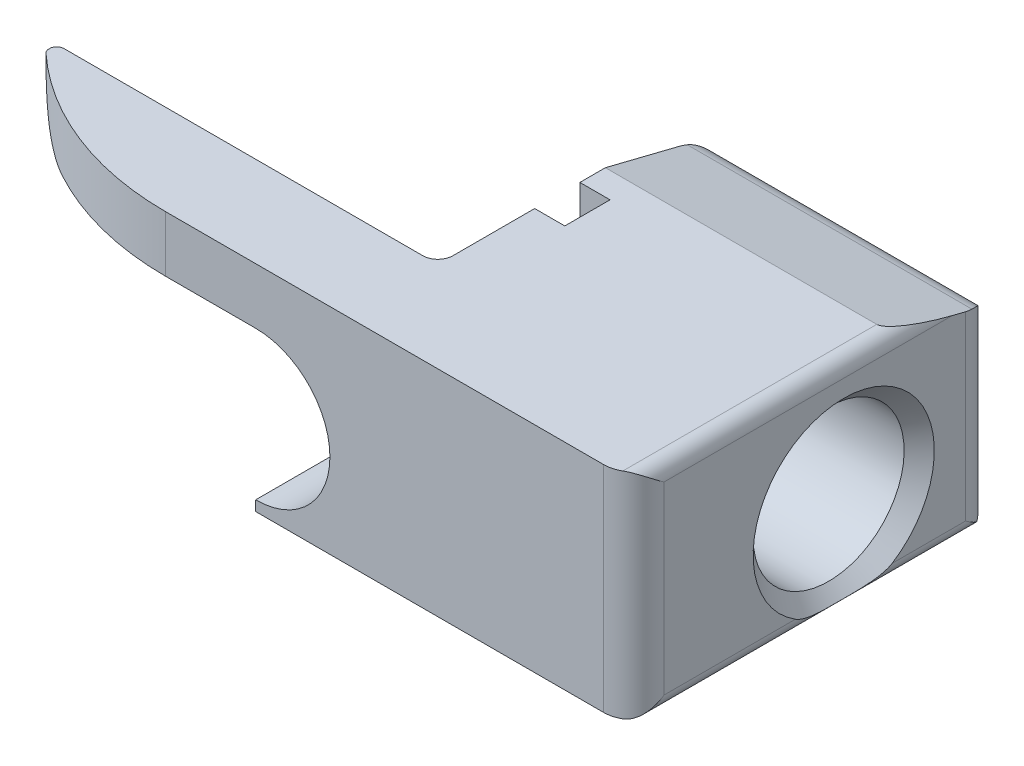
ISO-10303-21;
HEADER;
FILE_DESCRIPTION(('STEP AP214'),'2;1');
FILE_NAME('part.step','',(''),(''),'','','');
FILE_SCHEMA(('AUTOMOTIVE_DESIGN { 1 0 10303 214 1 1 1 1 }'));
ENDSEC;
DATA;
#1=APPLICATION_CONTEXT('core data for automotive mechanical design processes');
#2=APPLICATION_PROTOCOL_DEFINITION('international standard','automotive_design',2000,#1);
#3=PRODUCT_CONTEXT('',#1,'mechanical');
#4=PRODUCT('Part','Part','',(#3));
#5=PRODUCT_RELATED_PRODUCT_CATEGORY('part','',(#4));
#6=PRODUCT_DEFINITION_FORMATION('','',#4);
#7=PRODUCT_DEFINITION_CONTEXT('part definition',#1,'design');
#8=PRODUCT_DEFINITION('design','',#6,#7);
#9=PRODUCT_DEFINITION_SHAPE('','',#8);
#10=(LENGTH_UNIT() NAMED_UNIT(*) SI_UNIT(.MILLI.,.METRE.));
#11=(NAMED_UNIT(*) PLANE_ANGLE_UNIT() SI_UNIT($,.RADIAN.));
#12=(NAMED_UNIT(*) SI_UNIT($,.STERADIAN.) SOLID_ANGLE_UNIT());
#13=UNCERTAINTY_MEASURE_WITH_UNIT(LENGTH_MEASURE(1.E-05),#10,'distance_accuracy_value','');
#14=(GEOMETRIC_REPRESENTATION_CONTEXT(3) GLOBAL_UNCERTAINTY_ASSIGNED_CONTEXT((#13)) GLOBAL_UNIT_ASSIGNED_CONTEXT((#10,
#11,#12)) REPRESENTATION_CONTEXT('',''));
#15=CARTESIAN_POINT('',(0.,0.,0.));
#16=DIRECTION('',(0.,0.,1.));
#17=DIRECTION('',(1.,0.,0.));
#18=AXIS2_PLACEMENT_3D('',#15,#16,#17);
#19=CARTESIAN_POINT('',(-5.55624999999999,5.6515,-8.001));
#20=DIRECTION('',(0.,0.,1.));
#21=DIRECTION('',(1.,0.,0.));
#22=AXIS2_PLACEMENT_3D('',#19,#20,#21);
#23=PLANE('',#22);
#24=DIRECTION('',(0.,-1.,0.));
#25=VECTOR('',#24,1.);
#26=CARTESIAN_POINT('',(6.34999999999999,5.6515,-8.001));
#27=LINE('',#26,#25);
#28=CARTESIAN_POINT('',(6.34999999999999,3.04745640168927,-8.001));
#29=VERTEX_POINT('',#28);
#30=CARTESIAN_POINT('',(6.35,-4.064,-8.001));
#31=VERTEX_POINT('',#30);
#32=EDGE_CURVE('E295',#29,#31,#27,.T.);
#33=ORIENTED_EDGE('',*,*,#32,.T.);
#34=DIRECTION('',(1.,0.,0.));
#35=VECTOR('',#34,1.);
#36=CARTESIAN_POINT('',(-27.2138632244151,-4.064,-8.001));
#37=LINE('',#36,#35);
#38=CARTESIAN_POINT('',(-5.55625,-4.064,-8.001));
#39=VERTEX_POINT('',#38);
#40=EDGE_CURVE('E241',#39,#31,#37,.T.);
#41=ORIENTED_EDGE('',*,*,#40,.F.);
#42=DIRECTION('',(0.,-1.,0.));
#43=VECTOR('',#42,1.);
#44=CARTESIAN_POINT('',(-5.55624999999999,5.6515,-8.001));
#45=LINE('',#44,#43);
#46=CARTESIAN_POINT('',(-5.55625,3.04745640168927,-8.001));
#47=VERTEX_POINT('',#46);
#48=EDGE_CURVE('E252',#47,#39,#45,.T.);
#49=ORIENTED_EDGE('',*,*,#48,.F.);
#50=DIRECTION('',(1.,0.,0.));
#51=VECTOR('',#50,1.);
#52=CARTESIAN_POINT('',(-27.2138632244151,3.04745640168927,-8.001));
#53=LINE('',#52,#51);
#54=EDGE_CURVE('E519',#47,#29,#53,.T.);
#55=ORIENTED_EDGE('',*,*,#54,.T.);
#56=EDGE_LOOP('',(#33,#41,#49,#55));
#57=FACE_BOUND('',#56,.T.);
#58=ADVANCED_FACE('F35',(#57),#23,.F.);
#59=CARTESIAN_POINT('',(-7.14375,5.6515,1.190625));
#60=DIRECTION('',(0.,0.,1.));
#61=DIRECTION('',(1.,0.,0.));
#62=AXIS2_PLACEMENT_3D('',#59,#60,#61);
#63=PLANE('',#62);
#64=DIRECTION('',(0.,-1.,0.));
#65=VECTOR('',#64,1.);
#66=CARTESIAN_POINT('',(-7.14375,5.6515,1.190625));
#67=LINE('',#66,#65);
#68=CARTESIAN_POINT('',(-7.14375,-4.61810228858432,1.190625));
#69=VERTEX_POINT('',#68);
#70=CARTESIAN_POINT('',(-7.14375,-5.6515,1.190625));
#71=VERTEX_POINT('',#70);
#72=EDGE_CURVE('E321',#69,#71,#67,.T.);
#73=ORIENTED_EDGE('',*,*,#72,.F.);
#74=DIRECTION('',(1.,0.,0.));
#75=VECTOR('',#74,1.);
#76=CARTESIAN_POINT('',(-27.2138632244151,-4.61810228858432,1.190625));
#77=LINE('',#76,#75);
#78=CARTESIAN_POINT('',(-5.55625,-4.61810228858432,1.190625));
#79=VERTEX_POINT('',#78);
#80=EDGE_CURVE('E502',#69,#79,#77,.T.);
#81=ORIENTED_EDGE('',*,*,#80,.T.);
#82=DIRECTION('',(0.,-1.,0.));
#83=VECTOR('',#82,1.);
#84=CARTESIAN_POINT('',(-5.55625,5.6515,1.190625));
#85=LINE('',#84,#83);
#86=CARTESIAN_POINT('',(-5.55625,-5.6515,1.190625));
#87=VERTEX_POINT('',#86);
#88=EDGE_CURVE('E287',#79,#87,#85,.T.);
#89=ORIENTED_EDGE('',*,*,#88,.T.);
#90=DIRECTION('',(-1.,0.,0.));
#91=VECTOR('',#90,1.);
#92=CARTESIAN_POINT('',(-7.14375,-5.6515,1.190625));
#93=LINE('',#92,#91);
#94=EDGE_CURVE('E777',#87,#71,#93,.T.);
#95=ORIENTED_EDGE('',*,*,#94,.T.);
#96=EDGE_LOOP('',(#73,#81,#89,#95));
#97=FACE_BOUND('',#96,.T.);
#98=ADVANCED_FACE('F466',(#97),#63,.F.);
#99=CARTESIAN_POINT('',(-5.55625,5.6515,-1.190625));
#100=DIRECTION('',(0.,0.,-1.));
#101=DIRECTION('',(-1.,0.,0.));
#102=AXIS2_PLACEMENT_3D('',#99,#100,#101);
#103=PLANE('',#102);
#104=DIRECTION('',(0.,-1.,0.));
#105=VECTOR('',#104,1.);
#106=CARTESIAN_POINT('',(-7.14375,5.6515,-1.190625));
#107=LINE('',#106,#105);
#108=CARTESIAN_POINT('',(-7.14375,5.6515,-1.190625));
#109=VERTEX_POINT('',#108);
#110=CARTESIAN_POINT('',(-7.14375,2.96710228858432,-1.190625));
#111=VERTEX_POINT('',#110);
#112=EDGE_CURVE('E265',#109,#111,#107,.T.);
#113=ORIENTED_EDGE('',*,*,#112,.T.);
#114=DIRECTION('',(1.,0.,0.));
#115=VECTOR('',#114,1.);
#116=CARTESIAN_POINT('',(-27.2138632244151,2.96710228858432,-1.19062499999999));
#117=LINE('',#116,#115);
#118=CARTESIAN_POINT('',(-5.55625,2.96710228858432,-1.190625));
#119=VERTEX_POINT('',#118);
#120=EDGE_CURVE('E499',#111,#119,#117,.T.);
#121=ORIENTED_EDGE('',*,*,#120,.T.);
#122=DIRECTION('',(0.,-1.,0.));
#123=VECTOR('',#122,1.);
#124=CARTESIAN_POINT('',(-5.55625,5.6515,-1.190625));
#125=LINE('',#124,#123);
#126=CARTESIAN_POINT('',(-5.55625,5.6515,-1.190625));
#127=VERTEX_POINT('',#126);
#128=EDGE_CURVE('E288',#127,#119,#125,.T.);
#129=ORIENTED_EDGE('',*,*,#128,.F.);
#130=DIRECTION('',(1.,0.,0.));
#131=VECTOR('',#130,1.);
#132=CARTESIAN_POINT('',(-5.55625,5.6515,-1.190625));
#133=LINE('',#132,#131);
#134=EDGE_CURVE('E783',#109,#127,#133,.T.);
#135=ORIENTED_EDGE('',*,*,#134,.F.);
#136=EDGE_LOOP('',(#113,#121,#129,#135));
#137=FACE_BOUND('',#136,.T.);
#138=ADVANCED_FACE('F472',(#137),#103,.F.);
#139=CARTESIAN_POINT('',(-5.55625,5.6515,1.190625));
#140=DIRECTION('',(1.,0.,0.));
#141=DIRECTION('',(0.,0.,-1.));
#142=AXIS2_PLACEMENT_3D('',#139,#140,#141);
#143=PLANE('',#142);
#144=ORIENTED_EDGE('',*,*,#128,.T.);
#145=CARTESIAN_POINT('',(-5.55625,-0.825500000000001,0.));
#146=DIRECTION('',(1.,0.,0.));
#147=DIRECTION('',(0.,0.,-1.));
#148=AXIS2_PLACEMENT_3D('',#145,#146,#147);
#149=CIRCLE('',#148,3.9751);
#150=CARTESIAN_POINT('',(-5.55625,2.96710228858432,1.190625));
#151=VERTEX_POINT('',#150);
#152=EDGE_CURVE('E338',#119,#151,#149,.T.);
#153=ORIENTED_EDGE('',*,*,#152,.T.);
#154=CARTESIAN_POINT('',(-5.55625,5.6515,1.190625));
#155=VERTEX_POINT('',#154);
#156=EDGE_CURVE('E283',#155,#151,#85,.T.);
#157=ORIENTED_EDGE('',*,*,#156,.F.);
#158=DIRECTION('',(0.,0.,1.));
#159=VECTOR('',#158,1.);
#160=CARTESIAN_POINT('',(-5.55625,5.6515,1.190625));
#161=LINE('',#160,#159);
#162=EDGE_CURVE('E781',#127,#155,#161,.T.);
#163=ORIENTED_EDGE('',*,*,#162,.F.);
#164=EDGE_LOOP('',(#144,#153,#157,#163));
#165=FACE_BOUND('',#164,.T.);
#166=ADVANCED_FACE('F620',(#165),#143,.F.);
#167=CARTESIAN_POINT('',(7.9375,5.6515,-6.41349999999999));
#168=DIRECTION('',(-1.,0.,0.));
#169=DIRECTION('',(0.,0.,1.));
#170=AXIS2_PLACEMENT_3D('',#167,#168,#169);
#171=PLANE('',#170);
#172=DIRECTION('',(0.,0.,1.));
#173=VECTOR('',#172,1.);
#174=CARTESIAN_POINT('',(7.9375,-4.85775,-8.001));
#175=LINE('',#174,#173);
#176=CARTESIAN_POINT('',(7.9375,-4.85775,2.54615204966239));
#177=VERTEX_POINT('',#176);
#178=CARTESIAN_POINT('',(7.9375,-4.85775,9.46149999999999));
#179=VERTEX_POINT('',#178);
#180=EDGE_CURVE('E491',#177,#179,#175,.T.);
#181=ORIENTED_EDGE('',*,*,#180,.F.);
#182=CARTESIAN_POINT('',(7.9375,-0.825500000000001,0.));
#183=DIRECTION('',(-1.,0.,0.));
#184=DIRECTION('',(0.,0.,1.));
#185=AXIS2_PLACEMENT_3D('',#182,#183,#184);
#186=CIRCLE('',#185,4.76885);
#187=CARTESIAN_POINT('',(7.9375,-4.85775,-2.5461520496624));
#188=VERTEX_POINT('',#187);
#189=EDGE_CURVE('E48',#177,#188,#186,.T.);
#190=ORIENTED_EDGE('',*,*,#189,.T.);
#191=CARTESIAN_POINT('',(7.9375,-4.85775,-6.4135));
#192=VERTEX_POINT('',#191);
#193=EDGE_CURVE('E490',#192,#188,#175,.T.);
#194=ORIENTED_EDGE('',*,*,#193,.F.);
#195=DIRECTION('',(0.,-1.,0.));
#196=VECTOR('',#195,1.);
#197=CARTESIAN_POINT('',(7.9375,5.6515,-6.41349999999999));
#198=LINE('',#197,#196);
#199=CARTESIAN_POINT('',(7.9375,4.68355553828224,-6.4135));
#200=VERTEX_POINT('',#199);
#201=EDGE_CURVE('E298',#200,#192,#198,.T.);
#202=ORIENTED_EDGE('',*,*,#201,.F.);
#203=DIRECTION('',(0.,-0.241921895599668,-0.970295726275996));
#204=VECTOR('',#203,1.);
#205=CARTESIAN_POINT('',(7.9375,5.6515,-2.53128680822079));
#206=LINE('',#205,#204);
#207=CARTESIAN_POINT('',(7.9375,4.85775,-5.71484417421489));
#208=VERTEX_POINT('',#207);
#209=EDGE_CURVE('E253',#208,#200,#206,.T.);
#210=ORIENTED_EDGE('',*,*,#209,.F.);
#211=DIRECTION('',(0.,0.,1.));
#212=VECTOR('',#211,1.);
#213=CARTESIAN_POINT('',(7.9375,4.85775,-8.001));
#214=LINE('',#213,#212);
#215=CARTESIAN_POINT('',(7.9375,4.85775,9.46149999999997));
#216=VERTEX_POINT('',#215);
#217=EDGE_CURVE('E380',#208,#216,#214,.T.);
#218=ORIENTED_EDGE('',*,*,#217,.T.);
#219=DIRECTION('',(0.,-1.,0.));
#220=VECTOR('',#219,1.);
#221=CARTESIAN_POINT('',(7.9375,5.6515,9.46149999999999));
#222=LINE('',#221,#220);
#223=EDGE_CURVE('E300',#216,#179,#222,.T.);
#224=ORIENTED_EDGE('',*,*,#223,.T.);
#225=EDGE_LOOP('',(#181,#190,#194,#202,#210,#218,#224));
#226=FACE_BOUND('',#225,.T.);
#227=ADVANCED_FACE('F390',(#226),#171,.F.);
#228=CARTESIAN_POINT('',(-26.8169882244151,5.6515,6.683375));
#229=DIRECTION('',(0.,-1.,0.));
#230=DIRECTION('',(0.,0.,-1.));
#231=AXIS2_PLACEMENT_3D('',#228,#229,#230);
#232=CYLINDRICAL_SURFACE('',#231,0.396874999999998);
#233=CARTESIAN_POINT('',(-26.8169882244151,5.6515,6.683375));
#234=DIRECTION('',(0.,1.,0.));
#235=DIRECTION('',(0.,0.,-1.));
#236=AXIS2_PLACEMENT_3D('',#233,#234,#235);
#237=CIRCLE('',#236,0.396874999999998);
#238=CARTESIAN_POINT('',(-27.2056229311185,5.6515,6.76382890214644));
#239=VERTEX_POINT('',#238);
#240=CARTESIAN_POINT('',(-27.0871162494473,5.6515,6.97413368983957));
#241=VERTEX_POINT('',#240);
#242=EDGE_CURVE('E796',#239,#241,#237,.T.);
#243=ORIENTED_EDGE('',*,*,#242,.F.);
#244=CARTESIAN_POINT('',(-27.2056229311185,5.6515,6.76382890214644));
#245=CARTESIAN_POINT('',(-27.2016272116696,5.59617975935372,6.78311461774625));
#246=CARTESIAN_POINT('',(-27.1961810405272,5.54088956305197,6.80220251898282));
#247=CARTESIAN_POINT('',(-27.1823721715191,5.43058862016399,6.8395829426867));
#248=CARTESIAN_POINT('',(-27.1740180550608,5.3755775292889,6.85787762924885));
#249=CARTESIAN_POINT('',(-27.154353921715,5.26572547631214,6.8933901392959));
#250=CARTESIAN_POINT('',(-27.143043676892,5.21088452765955,6.91060787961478));
#251=CARTESIAN_POINT('',(-27.1173793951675,5.10129528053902,6.9435882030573));
#252=CARTESIAN_POINT('',(-27.1030164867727,5.04654773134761,6.95934634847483));
#253=CARTESIAN_POINT('',(-27.0871162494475,4.99196797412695,6.97413368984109));
#254=B_SPLINE_CURVE_WITH_KNOTS('',3,(#244,#245,#246,#247,#248,#249,#250,#251,#252,#253),
.UNSPECIFIED.,.F.,.F.,(4,2,2,2,4),(0.,0.17615452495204,0.351793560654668,0.527446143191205,
0.703616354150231),.UNSPECIFIED.);
#255=CARTESIAN_POINT('',(-27.0871162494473,4.99196797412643,6.97413368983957));
#256=VERTEX_POINT('',#255);
#257=EDGE_CURVE('E424',#239,#256,#254,.T.);
#258=ORIENTED_EDGE('',*,*,#257,.T.);
#259=DIRECTION('',(0.,-1.,0.));
#260=VECTOR('',#259,1.);
#261=CARTESIAN_POINT('',(-27.0871162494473,5.6515,6.97413368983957));
#262=LINE('',#261,#260);
#263=EDGE_CURVE('E309',#241,#256,#262,.T.);
#264=ORIENTED_EDGE('',*,*,#263,.F.);
#265=EDGE_LOOP('',(#243,#258,#264));
#266=FACE_BOUND('',#265,.T.);
#267=ADVANCED_FACE('F464',(#266),#232,.T.);
#268=ORIENTED_EDGE('',*,*,#156,.T.);
#269=DIRECTION('',(1.,0.,0.));
#270=VECTOR('',#269,1.);
#271=CARTESIAN_POINT('',(-27.2138632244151,2.96710228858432,1.190625));
#272=LINE('',#271,#270);
#273=CARTESIAN_POINT('',(-7.14375,2.96710228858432,1.190625));
#274=VERTEX_POINT('',#273);
#275=EDGE_CURVE('E492',#151,#274,#272,.F.);
#276=ORIENTED_EDGE('',*,*,#275,.T.);
#277=CARTESIAN_POINT('',(-7.14375,5.6515,1.190625));
#278=VERTEX_POINT('',#277);
#279=EDGE_CURVE('E322',#278,#274,#67,.T.);
#280=ORIENTED_EDGE('',*,*,#279,.F.);
#281=DIRECTION('',(-1.,0.,0.));
#282=VECTOR('',#281,1.);
#283=CARTESIAN_POINT('',(-7.14375,5.6515,1.190625));
#284=LINE('',#283,#282);
#285=EDGE_CURVE('E282',#155,#278,#284,.T.);
#286=ORIENTED_EDGE('',*,*,#285,.F.);
#287=EDGE_LOOP('',(#268,#276,#280,#286));
#288=FACE_BOUND('',#287,.T.);
#289=ADVANCED_FACE('F474',(#288),#63,.F.);
#290=CARTESIAN_POINT('',(-7.14375,5.6515,5.49274999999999));
#291=DIRECTION('',(1.,0.,0.));
#292=DIRECTION('',(0.,0.,-1.));
#293=AXIS2_PLACEMENT_3D('',#290,#291,#292);
#294=PLANE('',#293);
#295=ORIENTED_EDGE('',*,*,#279,.T.);
#296=CARTESIAN_POINT('',(-7.14375,-0.825500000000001,0.));
#297=DIRECTION('',(1.,0.,0.));
#298=DIRECTION('',(0.,0.,-1.));
#299=AXIS2_PLACEMENT_3D('',#296,#297,#298);
#300=CIRCLE('',#299,3.9751);
#301=EDGE_CURVE('E496',#274,#69,#300,.T.);
#302=ORIENTED_EDGE('',*,*,#301,.T.);
#303=ORIENTED_EDGE('',*,*,#72,.T.);
#304=DIRECTION('',(0.,0.,1.));
#305=VECTOR('',#304,1.);
#306=CARTESIAN_POINT('',(-7.14375,-5.6515,5.49274999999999));
#307=LINE('',#306,#305);
#308=CARTESIAN_POINT('',(-7.14375,-5.6515,5.49274999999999));
#309=VERTEX_POINT('',#308);
#310=EDGE_CURVE('E766',#71,#309,#307,.T.);
#311=ORIENTED_EDGE('',*,*,#310,.T.);
#312=DIRECTION('',(0.,-1.,0.));
#313=VECTOR('',#312,1.);
#314=CARTESIAN_POINT('',(-7.14375,5.6515,5.49274999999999));
#315=LINE('',#314,#313);
#316=CARTESIAN_POINT('',(-7.14375,5.6515,5.49274999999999));
#317=VERTEX_POINT('',#316);
#318=EDGE_CURVE('E318',#317,#309,#315,.T.);
#319=ORIENTED_EDGE('',*,*,#318,.F.);
#320=DIRECTION('',(0.,0.,1.));
#321=VECTOR('',#320,1.);
#322=CARTESIAN_POINT('',(-7.14375,5.6515,5.49274999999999));
#323=LINE('',#322,#321);
#324=EDGE_CURVE('E800',#278,#317,#323,.T.);
#325=ORIENTED_EDGE('',*,*,#324,.F.);
#326=EDGE_LOOP('',(#295,#302,#303,#311,#319,#325));
#327=FACE_BOUND('',#326,.T.);
#328=ADVANCED_FACE('F646',(#327),#294,.F.);
#329=CARTESIAN_POINT('',(-7.9375,5.6515,5.49275));
#330=DIRECTION('',(0.,-1.,0.));
#331=DIRECTION('',(0.,0.,-1.));
#332=AXIS2_PLACEMENT_3D('',#329,#330,#331);
#333=CYLINDRICAL_SURFACE('',#332,0.79375);
#334=CARTESIAN_POINT('',(-7.9375,-5.6515,5.49275));
#335=DIRECTION('',(0.,-1.,0.));
#336=DIRECTION('',(0.,0.,-1.));
#337=AXIS2_PLACEMENT_3D('',#334,#335,#336);
#338=CIRCLE('',#337,0.79375);
#339=CARTESIAN_POINT('',(-7.93750000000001,-5.6515,6.2865));
#340=VERTEX_POINT('',#339);
#341=EDGE_CURVE('E759',#309,#340,#338,.T.);
#342=ORIENTED_EDGE('',*,*,#341,.T.);
#343=DIRECTION('',(0.,-1.,0.));
#344=VECTOR('',#343,1.);
#345=CARTESIAN_POINT('',(-7.93750000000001,5.6515,6.2865));
#346=LINE('',#345,#344);
#347=CARTESIAN_POINT('',(-7.93750000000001,5.6515,6.2865));
#348=VERTEX_POINT('',#347);
#349=EDGE_CURVE('E315',#348,#340,#346,.T.);
#350=ORIENTED_EDGE('',*,*,#349,.F.);
#351=CARTESIAN_POINT('',(-7.9375,5.6515,5.49275));
#352=DIRECTION('',(0.,-1.,0.));
#353=DIRECTION('',(0.,0.,-1.));
#354=AXIS2_PLACEMENT_3D('',#351,#352,#353);
#355=CIRCLE('',#354,0.79375);
#356=EDGE_CURVE('E798',#317,#348,#355,.T.);
#357=ORIENTED_EDGE('',*,*,#356,.F.);
#358=ORIENTED_EDGE('',*,*,#318,.T.);
#359=EDGE_LOOP('',(#342,#350,#357,#358));
#360=FACE_BOUND('',#359,.T.);
#361=ADVANCED_FACE('F651',(#360),#333,.F.);
#362=CARTESIAN_POINT('',(-7.93750000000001,5.6515,6.2865));
#363=DIRECTION('',(0.,0.,1.));
#364=DIRECTION('',(1.,0.,0.));
#365=AXIS2_PLACEMENT_3D('',#362,#363,#364);
#366=PLANE('',#365);
#367=DIRECTION('',(-1.,0.,0.));
#368=VECTOR('',#367,1.);
#369=CARTESIAN_POINT('',(-7.93750000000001,2.7051,6.2865));
#370=LINE('',#369,#368);
#371=CARTESIAN_POINT('',(-11.9761,2.7051,6.2865));
#372=VERTEX_POINT('',#371);
#373=CARTESIAN_POINT('',(-24.0388632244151,2.7051,6.2865));
#374=VERTEX_POINT('',#373);
#375=EDGE_CURVE('E780',#372,#374,#370,.T.);
#376=ORIENTED_EDGE('',*,*,#375,.T.);
#377=CARTESIAN_POINT('',(-24.0388632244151,5.8801,6.2865));
#378=DIRECTION('',(0.,0.,1.));
#379=DIRECTION('',(1.,0.,0.));
#380=AXIS2_PLACEMENT_3D('',#377,#378,#379);
#381=CIRCLE('',#380,3.175);
#382=CARTESIAN_POINT('',(-26.8169882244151,4.34300973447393,6.2865));
#383=VERTEX_POINT('',#382);
#384=EDGE_CURVE('E451',#374,#383,#381,.F.);
#385=ORIENTED_EDGE('',*,*,#384,.T.);
#386=DIRECTION('',(0.,-1.,0.));
#387=VECTOR('',#386,1.);
#388=CARTESIAN_POINT('',(-26.8169882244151,5.6515,6.2865));
#389=LINE('',#388,#387);
#390=CARTESIAN_POINT('',(-26.8169882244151,5.6515,6.2865));
#391=VERTEX_POINT('',#390);
#392=EDGE_CURVE('E312',#391,#383,#389,.T.);
#393=ORIENTED_EDGE('',*,*,#392,.F.);
#394=DIRECTION('',(-1.,0.,0.));
#395=VECTOR('',#394,1.);
#396=CARTESIAN_POINT('',(-7.93750000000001,5.6515,6.2865));
#397=LINE('',#396,#395);
#398=EDGE_CURVE('E771',#348,#391,#397,.T.);
#399=ORIENTED_EDGE('',*,*,#398,.F.);
#400=ORIENTED_EDGE('',*,*,#349,.T.);
#401=DIRECTION('',(-1.,0.,0.));
#402=VECTOR('',#401,1.);
#403=CARTESIAN_POINT('',(-7.93750000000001,-5.6515,6.2865));
#404=LINE('',#403,#402);
#405=CARTESIAN_POINT('',(-11.9761,-5.6515,6.2865));
#406=VERTEX_POINT('',#405);
#407=EDGE_CURVE('E765',#340,#406,#404,.T.);
#408=ORIENTED_EDGE('',*,*,#407,.T.);
#409=DIRECTION('',(0.,1.,0.));
#410=VECTOR('',#409,1.);
#411=CARTESIAN_POINT('',(-11.9761,5.6515,6.2865));
#412=LINE('',#411,#410);
#413=CARTESIAN_POINT('',(-11.9761,-5.1181,6.2865));
#414=VERTEX_POINT('',#413);
#415=EDGE_CURVE('E411',#406,#414,#412,.T.);
#416=ORIENTED_EDGE('',*,*,#415,.T.);
#417=CARTESIAN_POINT('',(-11.9761,-1.2065,6.2865));
#418=DIRECTION('',(0.,0.,1.));
#419=DIRECTION('',(1.,0.,0.));
#420=AXIS2_PLACEMENT_3D('',#417,#418,#419);
#421=CIRCLE('',#420,3.9116);
#422=EDGE_CURVE('E450',#414,#372,#421,.T.);
#423=ORIENTED_EDGE('',*,*,#422,.T.);
#424=EDGE_LOOP('',(#376,#385,#393,#399,#400,#408,#416,#423));
#425=FACE_BOUND('',#424,.T.);
#426=ADVANCED_FACE('F462',(#425),#366,.F.);
#427=ORIENTED_EDGE('',*,*,#392,.T.);
#428=CARTESIAN_POINT('',(-26.8169882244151,4.34300973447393,6.2865));
#429=CARTESIAN_POINT('',(-26.8297774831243,4.36612397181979,6.28650366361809));
#430=CARTESIAN_POINT('',(-26.8422731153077,4.38939052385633,6.28711768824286));
#431=CARTESIAN_POINT('',(-26.866654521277,4.43617607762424,6.28942893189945));
#432=CARTESIAN_POINT('',(-26.8785405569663,4.45969496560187,6.29112568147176));
#433=CARTESIAN_POINT('',(-26.9132163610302,4.53047955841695,6.2976253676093));
#434=CARTESIAN_POINT('',(-26.9350794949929,4.57807391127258,6.30383895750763));
#435=CARTESIAN_POINT('',(-26.9759456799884,4.67311700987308,6.31908095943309));
#436=CARTESIAN_POINT('',(-26.9949878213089,4.72055657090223,6.32806423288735));
#437=CARTESIAN_POINT('',(-27.0306330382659,4.81589612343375,6.34828463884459));
#438=CARTESIAN_POINT('',(-27.0472346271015,4.86379637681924,6.35952313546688));
#439=CARTESIAN_POINT('',(-27.081958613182,4.97223703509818,6.38688443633));
#440=CARTESIAN_POINT('',(-27.0993808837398,5.03287165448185,6.40352091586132));
#441=CARTESIAN_POINT('',(-27.1304753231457,5.15449668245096,6.43885671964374));
#442=CARTESIAN_POINT('',(-27.1441470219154,5.2154871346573,6.45755630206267));
#443=CARTESIAN_POINT('',(-27.1680438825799,5.33891249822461,6.496805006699));
#444=CARTESIAN_POINT('',(-27.1781958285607,5.40135219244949,6.51738331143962));
#445=CARTESIAN_POINT('',(-27.1947229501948,5.5263494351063,6.55953346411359));
#446=CARTESIAN_POINT('',(-27.2011007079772,5.58890687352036,6.58110462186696));
#447=CARTESIAN_POINT('',(-27.2056229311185,5.6515,6.60292109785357));
#448=B_SPLINE_CURVE_WITH_KNOTS('',3,(#428,#429,#430,#431,#432,#433,#434,#435,#436,#437,#438,
#439,#440,#441,#442,#443,#444,#445,#446,#447),.UNSPECIFIED.,.F.,.F.,(4,2,2,2,2,2,2,2,2,4),(0.,
0.0792263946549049,0.158418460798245,0.316458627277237,0.472048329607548,0.627732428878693,
0.823304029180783,1.01890013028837,1.21835012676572,1.41766351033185),.UNSPECIFIED.);
#449=CARTESIAN_POINT('',(-27.2056229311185,5.6515,6.60292109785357));
#450=VERTEX_POINT('',#449);
#451=EDGE_CURVE('E417',#383,#450,#448,.T.);
#452=ORIENTED_EDGE('',*,*,#451,.T.);
#453=EDGE_CURVE('E793',#391,#450,#237,.T.);
#454=ORIENTED_EDGE('',*,*,#453,.F.);
#455=EDGE_LOOP('',(#427,#452,#454));
#456=FACE_BOUND('',#455,.T.);
#457=ADVANCED_FACE('F429',(#456),#232,.T.);
#458=CARTESIAN_POINT('',(-16.7142000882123,5.6515,-4.191));
#459=DIRECTION('',(0.,-1.,0.));
#460=DIRECTION('',(0.,0.,-1.));
#461=AXIS2_PLACEMENT_3D('',#458,#459,#460);
#462=CYLINDRICAL_SURFACE('',#461,15.24);
#463=ORIENTED_EDGE('',*,*,#263,.T.);
#464=CARTESIAN_POINT('',(-27.0871162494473,4.99196797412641,6.97413368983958));
#465=CARTESIAN_POINT('',(-27.0373339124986,4.82116695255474,7.02040804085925));
#466=CARTESIAN_POINT('',(-26.9744046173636,4.65847848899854,7.07824687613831));
#467=CARTESIAN_POINT('',(-26.8271865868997,4.35219887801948,7.21051606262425));
#468=CARTESIAN_POINT('',(-26.7430831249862,4.20845776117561,7.28480185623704));
#469=CARTESIAN_POINT('',(-26.5580843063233,3.94090235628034,7.44387795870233));
#470=CARTESIAN_POINT('',(-26.4573053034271,3.81696093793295,7.52859450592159));
#471=CARTESIAN_POINT('',(-26.2411334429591,3.58760845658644,7.70499385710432));
#472=CARTESIAN_POINT('',(-26.1257023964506,3.48224760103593,7.79669460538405));
#473=CARTESIAN_POINT('',(-25.8564744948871,3.27007205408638,8.00371260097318));
#474=CARTESIAN_POINT('',(-25.6997558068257,3.16777991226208,8.11988118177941));
#475=CARTESIAN_POINT('',(-25.3714132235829,2.99225923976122,8.3529595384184));
#476=CARTESIAN_POINT('',(-25.1997868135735,2.91903562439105,8.46986943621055));
#477=CARTESIAN_POINT('',(-24.8224203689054,2.79616605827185,8.71523029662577));
#478=CARTESIAN_POINT('',(-24.6150854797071,2.7505512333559,8.84332241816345));
#479=CARTESIAN_POINT('',(-24.2970122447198,2.71380619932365,9.0292052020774));
#480=CARTESIAN_POINT('',(-24.1897375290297,2.70684316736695,9.09016103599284));
#481=CARTESIAN_POINT('',(-23.9736403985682,2.70393450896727,9.20949616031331));
#482=CARTESIAN_POINT('',(-23.8648189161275,2.70798250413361,9.26787692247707));
#483=CARTESIAN_POINT('',(-23.6523393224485,2.72700635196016,9.37857727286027));
#484=CARTESIAN_POINT('',(-23.5487104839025,2.74139659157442,9.43105415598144));
#485=CARTESIAN_POINT('',(-23.3419560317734,2.78074371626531,9.53283740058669));
#486=CARTESIAN_POINT('',(-23.2388301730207,2.80569479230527,9.58214548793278));
#487=CARTESIAN_POINT('',(-23.0341919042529,2.86635753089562,9.67723812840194));
#488=CARTESIAN_POINT('',(-22.9326786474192,2.9020633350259,9.72302458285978));
#489=CARTESIAN_POINT('',(-22.7324381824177,2.98431211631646,9.8107982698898));
#490=CARTESIAN_POINT('',(-22.6337105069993,3.03085326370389,9.85278614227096));
#491=CARTESIAN_POINT('',(-22.4530254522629,3.12785751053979,9.92748989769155));
#492=CARTESIAN_POINT('',(-22.370565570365,3.17700789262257,9.96069983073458));
#493=CARTESIAN_POINT('',(-22.2096284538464,3.28321409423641,10.0239688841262));
#494=CARTESIAN_POINT('',(-22.1311506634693,3.34026880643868,10.0540284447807));
#495=CARTESIAN_POINT('',(-21.979110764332,3.46193549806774,10.1109195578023));
#496=CARTESIAN_POINT('',(-21.9055457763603,3.52654298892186,10.1377530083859));
#497=CARTESIAN_POINT('',(-21.7641543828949,3.66290168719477,10.1881931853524));
#498=CARTESIAN_POINT('',(-21.6963275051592,3.73465230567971,10.2118001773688));
#499=CARTESIAN_POINT('',(-21.5737276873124,3.87718710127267,10.2535961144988));
#500=CARTESIAN_POINT('',(-21.5183278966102,3.94734366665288,10.2720911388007));
#501=CARTESIAN_POINT('',(-21.4133672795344,4.09252541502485,10.3065335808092));
#502=CARTESIAN_POINT('',(-21.3638084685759,4.16755226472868,10.3224801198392));
#503=CARTESIAN_POINT('',(-21.2710810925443,4.32186394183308,10.3518608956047));
#504=CARTESIAN_POINT('',(-21.227908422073,4.40114598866,10.3652967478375));
#505=CARTESIAN_POINT('',(-21.1483397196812,4.5634064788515,10.3897315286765));
#506=CARTESIAN_POINT('',(-21.1119461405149,4.64638624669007,10.4007295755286));
#507=CARTESIAN_POINT('',(-21.0222297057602,4.87750647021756,10.4275519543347));
#508=CARTESIAN_POINT('',(-20.9760576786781,5.02881610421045,10.4410029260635));
#509=CARTESIAN_POINT('',(-20.9240364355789,5.25981787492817,10.4560196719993));
#510=CARTESIAN_POINT('',(-20.9095658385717,5.33753210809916,10.4601661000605));
#511=CARTESIAN_POINT('',(-20.8864488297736,5.49390683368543,10.46676475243));
#512=CARTESIAN_POINT('',(-20.877803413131,5.57256748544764,10.4692166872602));
#513=CARTESIAN_POINT('',(-20.8721035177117,5.6515,10.470836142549));
#514=B_SPLINE_CURVE_WITH_KNOTS('',3,(#464,#465,#466,#467,#468,#469,#470,#471,#472,#473,#474,
#475,#476,#477,#478,#479,#480,#481,#482,#483,#484,#485,#486,#487,#488,#489,#490,#491,#492,#493,
#494,#495,#496,#497,#498,#499,#500,#501,#502,#503,#504,#505,#506,#507,#508,#509,#510,#511,#512,
#513),.UNSPECIFIED.,.F.,.F.,(4,2,2,2,2,2,2,2,2,2,2,2,2,2,2,2,2,2,2,2,2,2,2,2,4),(0.,
0.548957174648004,1.09326849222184,1.63393071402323,2.17603221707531,2.83424978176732,
3.49257859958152,4.23224988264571,4.60256582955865,4.97266730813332,5.32331423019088,
5.67376852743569,6.02403226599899,6.3742368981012,6.67855931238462,6.98283913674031,
7.28693903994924,7.59101389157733,7.8645283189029,8.13813684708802,8.41156871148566,
8.6850993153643,9.15917379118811,9.39645371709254,9.6337741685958),.UNSPECIFIED.);
#515=CARTESIAN_POINT('',(-24.0388632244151,2.7051,9.17338962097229));
#516=VERTEX_POINT('',#515);
#517=EDGE_CURVE('E444',#256,#516,#514,.T.);
#518=ORIENTED_EDGE('',*,*,#517,.T.);
#519=CARTESIAN_POINT('',(-16.7142000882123,2.7051,-4.191));
#520=DIRECTION('',(0.,1.,0.));
#521=DIRECTION('',(-1.,0.,0.));
#522=AXIS2_PLACEMENT_3D('',#519,#520,#521);
#523=CIRCLE('',#522,15.24);
#524=CARTESIAN_POINT('',(-16.7142000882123,2.7051,11.049));
#525=VERTEX_POINT('',#524);
#526=EDGE_CURVE('E804',#516,#525,#523,.T.);
#527=ORIENTED_EDGE('',*,*,#526,.T.);
#528=DIRECTION('',(0.,-1.,0.));
#529=VECTOR('',#528,1.);
#530=CARTESIAN_POINT('',(-16.7142000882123,5.6515,11.049));
#531=LINE('',#530,#529);
#532=CARTESIAN_POINT('',(-16.7142000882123,5.6515,11.049));
#533=VERTEX_POINT('',#532);
#534=EDGE_CURVE('E306',#533,#525,#531,.T.);
#535=ORIENTED_EDGE('',*,*,#534,.F.);
#536=CARTESIAN_POINT('',(-16.7142000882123,5.6515,-4.191));
#537=DIRECTION('',(0.,1.,0.));
#538=DIRECTION('',(0.,0.,-1.));
#539=AXIS2_PLACEMENT_3D('',#536,#537,#538);
#540=CIRCLE('',#539,15.24);
#541=EDGE_CURVE('E791',#241,#533,#540,.T.);
#542=ORIENTED_EDGE('',*,*,#541,.F.);
#543=EDGE_LOOP('',(#463,#518,#527,#535,#542));
#544=FACE_BOUND('',#543,.T.);
#545=ADVANCED_FACE('F453',(#544),#462,.T.);
#546=CARTESIAN_POINT('',(6.34999999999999,5.6515,11.049));
#547=DIRECTION('',(0.,0.,-1.));
#548=DIRECTION('',(-1.,0.,0.));
#549=AXIS2_PLACEMENT_3D('',#546,#547,#548);
#550=PLANE('',#549);
#551=ORIENTED_EDGE('',*,*,#534,.T.);
#552=DIRECTION('',(-1.,0.,0.));
#553=VECTOR('',#552,1.);
#554=CARTESIAN_POINT('',(-11.9761,2.7051,11.049));
#555=LINE('',#554,#553);
#556=CARTESIAN_POINT('',(-11.9761,2.7051,11.049));
#557=VERTEX_POINT('',#556);
#558=EDGE_CURVE('E405',#557,#525,#555,.T.);
#559=ORIENTED_EDGE('',*,*,#558,.F.);
#560=CARTESIAN_POINT('',(-11.9761,-1.2065,11.049));
#561=DIRECTION('',(0.,0.,1.));
#562=DIRECTION('',(1.,0.,0.));
#563=AXIS2_PLACEMENT_3D('',#560,#561,#562);
#564=CIRCLE('',#563,3.9116);
#565=CARTESIAN_POINT('',(-11.9761,-5.1181,11.049));
#566=VERTEX_POINT('',#565);
#567=EDGE_CURVE('E402',#566,#557,#564,.T.);
#568=ORIENTED_EDGE('',*,*,#567,.F.);
#569=DIRECTION('',(0.,1.,0.));
#570=VECTOR('',#569,1.);
#571=CARTESIAN_POINT('',(-11.9761,-5.6515,11.049));
#572=LINE('',#571,#570);
#573=CARTESIAN_POINT('',(-11.9761,-5.6515,11.049));
#574=VERTEX_POINT('',#573);
#575=EDGE_CURVE('E399',#574,#566,#572,.T.);
#576=ORIENTED_EDGE('',*,*,#575,.F.);
#577=DIRECTION('',(1.,0.,0.));
#578=VECTOR('',#577,1.);
#579=CARTESIAN_POINT('',(6.34999999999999,-5.6515,11.049));
#580=LINE('',#579,#578);
#581=CARTESIAN_POINT('',(6.34999999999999,-5.6515,11.049));
#582=VERTEX_POINT('',#581);
#583=EDGE_CURVE('E276',#574,#582,#580,.T.);
#584=ORIENTED_EDGE('',*,*,#583,.T.);
#585=DIRECTION('',(0.,-1.,0.));
#586=VECTOR('',#585,1.);
#587=CARTESIAN_POINT('',(6.34999999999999,5.6515,11.049));
#588=LINE('',#587,#586);
#589=CARTESIAN_POINT('',(6.34999999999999,5.6515,11.049));
#590=VERTEX_POINT('',#589);
#591=EDGE_CURVE('E303',#590,#582,#588,.T.);
#592=ORIENTED_EDGE('',*,*,#591,.F.);
#593=DIRECTION('',(1.,0.,0.));
#594=VECTOR('',#593,1.);
#595=CARTESIAN_POINT('',(6.34999999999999,5.6515,11.049));
#596=LINE('',#595,#594);
#597=EDGE_CURVE('E789',#533,#590,#596,.T.);
#598=ORIENTED_EDGE('',*,*,#597,.F.);
#599=EDGE_LOOP('',(#551,#559,#568,#576,#584,#592,#598));
#600=FACE_BOUND('',#599,.T.);
#601=ADVANCED_FACE('F388',(#600),#550,.F.);
#602=CARTESIAN_POINT('',(6.35,5.6515,9.4615));
#603=DIRECTION('',(0.,-1.,0.));
#604=DIRECTION('',(0.,0.,-1.));
#605=AXIS2_PLACEMENT_3D('',#602,#603,#604);
#606=CYLINDRICAL_SURFACE('',#605,1.5875);
#607=CARTESIAN_POINT('',(6.35,-5.6515,9.4615));
#608=DIRECTION('',(0.,1.,0.));
#609=DIRECTION('',(0.,0.,-1.));
#610=AXIS2_PLACEMENT_3D('',#607,#608,#609);
#611=CIRCLE('',#610,1.5875);
#612=CARTESIAN_POINT('',(7.14375,-5.6515,10.8363153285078));
#613=VERTEX_POINT('',#612);
#614=EDGE_CURVE('E271',#582,#613,#611,.T.);
#615=ORIENTED_EDGE('',*,*,#614,.T.);
#616=CARTESIAN_POINT('',(7.14375,-5.6515,10.8363153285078));
#617=CARTESIAN_POINT('',(7.17348880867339,-5.65149884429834,10.8191547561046));
#618=CARTESIAN_POINT('',(7.20261780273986,-5.64982993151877,10.8010414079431));
#619=CARTESIAN_POINT('',(7.25936220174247,-5.64355250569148,10.7631801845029));
#620=CARTESIAN_POINT('',(7.28698125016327,-5.63895144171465,10.7434365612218));
#621=CARTESIAN_POINT('',(7.36661382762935,-5.62148958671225,10.6825939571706));
#622=CARTESIAN_POINT('',(7.41623620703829,-5.60494755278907,10.639395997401));
#623=CARTESIAN_POINT('',(7.51703132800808,-5.56080613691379,10.5404376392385));
#624=CARTESIAN_POINT('',(7.56669702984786,-5.53170021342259,10.4838521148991));
#625=CARTESIAN_POINT('',(7.65624890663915,-5.46641322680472,10.3666771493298));
#626=CARTESIAN_POINT('',(7.69607401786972,-5.43019037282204,10.3060655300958));
#627=CARTESIAN_POINT('',(7.78038875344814,-5.33743793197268,10.1572958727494));
#628=CARTESIAN_POINT('',(7.82022585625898,-5.27862863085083,10.0679306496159));
#629=CARTESIAN_POINT('',(7.88244145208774,-5.15621672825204,9.88687070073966));
#630=CARTESIAN_POINT('',(7.90484257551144,-5.09262045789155,9.79517915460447));
#631=CARTESIAN_POINT('',(7.93104215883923,-4.97325983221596,9.624873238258));
#632=CARTESIAN_POINT('',(7.93716551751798,-4.91778897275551,9.54640840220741));
#633=CARTESIAN_POINT('',(7.93749555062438,-4.8608171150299,9.46583755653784));
#634=CARTESIAN_POINT('',(7.93749999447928,-4.85928353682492,9.46366874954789));
#635=CARTESIAN_POINT('',(7.9375,-4.85775,9.46150000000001));
#636=B_SPLINE_CURVE_WITH_KNOTS('',3,(#616,#617,#618,#619,#620,#621,#622,#623,#624,#625,#626,
#627,#628,#629,#630,#631,#632,#633,#634,#635),.UNSPECIFIED.,.F.,.F.,(4,2,2,2,2,2,2,2,2,4),(0.,
0.102863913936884,0.205467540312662,0.407831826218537,0.648764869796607,0.89115740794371,
1.23180088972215,1.57200150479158,1.86006221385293,1.86803091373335),.UNSPECIFIED.);
#637=EDGE_CURVE('E373',#613,#179,#636,.T.);
#638=ORIENTED_EDGE('',*,*,#637,.T.);
#639=ORIENTED_EDGE('',*,*,#223,.F.);
#640=CARTESIAN_POINT('',(7.14375,5.6515,10.8363153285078));
#641=CARTESIAN_POINT('',(7.17348880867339,5.65149884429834,10.8191547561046));
#642=CARTESIAN_POINT('',(7.20261780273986,5.64982993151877,10.8010414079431));
#643=CARTESIAN_POINT('',(7.25936220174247,5.64355250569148,10.7631801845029));
#644=CARTESIAN_POINT('',(7.28698125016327,5.63895144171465,10.7434365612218));
#645=CARTESIAN_POINT('',(7.36661382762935,5.62148958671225,10.6825939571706));
#646=CARTESIAN_POINT('',(7.41623620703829,5.60494755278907,10.639395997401));
#647=CARTESIAN_POINT('',(7.51703132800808,5.56080613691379,10.5404376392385));
#648=CARTESIAN_POINT('',(7.56669702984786,5.53170021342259,10.4838521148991));
#649=CARTESIAN_POINT('',(7.65624890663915,5.46641322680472,10.3666771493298));
#650=CARTESIAN_POINT('',(7.69607401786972,5.43019037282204,10.3060655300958));
#651=CARTESIAN_POINT('',(7.78038875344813,5.33743793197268,10.1572958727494));
#652=CARTESIAN_POINT('',(7.82022585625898,5.27862863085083,10.0679306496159));
#653=CARTESIAN_POINT('',(7.88244145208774,5.15621672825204,9.88687070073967));
#654=CARTESIAN_POINT('',(7.90484257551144,5.09262045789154,9.79517915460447));
#655=CARTESIAN_POINT('',(7.93104215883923,4.97325983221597,9.624873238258));
#656=CARTESIAN_POINT('',(7.93716551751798,4.91778897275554,9.54640840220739));
#657=CARTESIAN_POINT('',(7.93749555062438,4.8608171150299,9.46583755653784));
#658=CARTESIAN_POINT('',(7.93749999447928,4.85928353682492,9.46366874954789));
#659=CARTESIAN_POINT('',(7.9375,4.85775,9.46150000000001));
#660=B_SPLINE_CURVE_WITH_KNOTS('',3,(#640,#641,#642,#643,#644,#645,#646,#647,#648,#649,#650,
#651,#652,#653,#654,#655,#656,#657,#658,#659),.UNSPECIFIED.,.F.,.F.,(4,2,2,2,2,2,2,2,2,4),(0.,
0.102863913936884,0.205467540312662,0.407831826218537,0.648764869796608,0.891157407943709,
1.23180088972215,1.57200150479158,1.86006221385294,1.86803091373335),.UNSPECIFIED.);
#661=CARTESIAN_POINT('',(7.14375,5.6515,10.8363153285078));
#662=VERTEX_POINT('',#661);
#663=EDGE_CURVE('E393',#216,#662,#660,.F.);
#664=ORIENTED_EDGE('',*,*,#663,.T.);
#665=CARTESIAN_POINT('',(6.35,5.6515,9.4615));
#666=DIRECTION('',(0.,1.,0.));
#667=DIRECTION('',(0.,0.,-1.));
#668=AXIS2_PLACEMENT_3D('',#665,#666,#667);
#669=CIRCLE('',#668,1.5875);
#670=EDGE_CURVE('E787',#590,#662,#669,.T.);
#671=ORIENTED_EDGE('',*,*,#670,.F.);
#672=ORIENTED_EDGE('',*,*,#591,.T.);
#673=EDGE_LOOP('',(#615,#638,#639,#664,#671,#672));
#674=FACE_BOUND('',#673,.T.);
#675=ADVANCED_FACE('F382',(#674),#606,.T.);
#676=CARTESIAN_POINT('',(6.35,5.6515,-6.4135));
#677=DIRECTION('',(0.,-1.,0.));
#678=DIRECTION('',(0.,0.,-1.));
#679=AXIS2_PLACEMENT_3D('',#676,#677,#678);
#680=CYLINDRICAL_SURFACE('',#679,1.5875);
#681=CARTESIAN_POINT('',(7.14375,-5.6515,-7.7883153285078));
#682=CARTESIAN_POINT('',(7.17348880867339,-5.65149884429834,-7.77115475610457));
#683=CARTESIAN_POINT('',(7.20261780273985,-5.64982993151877,-7.75304140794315));
#684=CARTESIAN_POINT('',(7.25936220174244,-5.64355250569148,-7.7151801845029));
#685=CARTESIAN_POINT('',(7.28698125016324,-5.63895144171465,-7.69543656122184));
#686=CARTESIAN_POINT('',(7.36661382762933,-5.62148958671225,-7.63459395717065));
#687=CARTESIAN_POINT('',(7.41623620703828,-5.60494755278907,-7.59139599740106));
#688=CARTESIAN_POINT('',(7.51703132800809,-5.56080613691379,-7.49243763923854));
#689=CARTESIAN_POINT('',(7.56669702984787,-5.5317002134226,-7.43585211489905));
#690=CARTESIAN_POINT('',(7.65624890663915,-5.4664132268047,-7.31867714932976));
#691=CARTESIAN_POINT('',(7.69607401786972,-5.43019037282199,-7.25806553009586));
#692=CARTESIAN_POINT('',(7.78038875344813,-5.33743793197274,-7.10929587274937));
#693=CARTESIAN_POINT('',(7.82022585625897,-5.27862863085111,-7.01993064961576));
#694=CARTESIAN_POINT('',(7.88244145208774,-5.15621672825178,-6.83887070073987));
#695=CARTESIAN_POINT('',(7.90484257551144,-5.09262045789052,-6.74717915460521));
#696=CARTESIAN_POINT('',(7.93104215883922,-4.97325983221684,-6.57687323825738));
#697=CARTESIAN_POINT('',(7.93716551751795,-4.91778897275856,-6.49840840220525));
#698=CARTESIAN_POINT('',(7.93749555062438,-4.86081711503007,-6.41783755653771));
#699=CARTESIAN_POINT('',(7.93749999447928,-4.85928353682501,-6.41566874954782));
#700=CARTESIAN_POINT('',(7.9375,-4.85775,-6.4135));
#701=B_SPLINE_CURVE_WITH_KNOTS('',3,(#681,#682,#683,#684,#685,#686,#687,#688,#689,#690,#691,
#692,#693,#694,#695,#696,#697,#698,#699,#700),.UNSPECIFIED.,.F.,.F.,(4,2,2,2,2,2,2,2,2,4),(0.,
0.102863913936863,0.205467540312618,0.407831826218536,0.648764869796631,0.891157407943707,
1.23180088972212,1.57200150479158,1.86006221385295,1.86803091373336),.UNSPECIFIED.);
#702=CARTESIAN_POINT('',(7.70501600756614,-5.41901600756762,-7.24059604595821));
#703=VERTEX_POINT('',#702);
#704=EDGE_CURVE('E365',#192,#703,#701,.F.);
#705=ORIENTED_EDGE('',*,*,#704,.T.);
#706=CARTESIAN_POINT('',(6.35,-4.064,-6.4135));
#707=DIRECTION('',(-0.707106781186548,-0.707106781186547,0.));
#708=DIRECTION('',(0.707106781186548,-0.707106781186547,0.));
#709=AXIS2_PLACEMENT_3D('',#706,#707,#708);
#710=ELLIPSE('',#709,2.24506403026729,1.5875);
#711=EDGE_CURVE('E254',#703,#31,#710,.F.);
#712=ORIENTED_EDGE('',*,*,#711,.T.);
#713=ORIENTED_EDGE('',*,*,#32,.F.);
#714=CARTESIAN_POINT('',(6.35,3.04745640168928,-6.4135));
#715=DIRECTION('',(0.707106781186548,-0.707106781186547,0.));
#716=DIRECTION('',(-0.707106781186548,-0.707106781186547,0.));
#717=AXIS2_PLACEMENT_3D('',#714,#715,#716);
#718=ELLIPSE('',#717,2.24506403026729,1.5875);
#719=CARTESIAN_POINT('',(7.89034446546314,4.58780086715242,-6.79755100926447));
#720=VERTEX_POINT('',#719);
#721=EDGE_CURVE('E511',#29,#720,#718,.T.);
#722=ORIENTED_EDGE('',*,*,#721,.T.);
#723=CARTESIAN_POINT('',(6.35,4.68355553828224,-6.4135));
#724=DIRECTION('',(0.,-0.970295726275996,0.241921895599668));
#725=DIRECTION('',(0.,-0.241921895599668,-0.970295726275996));
#726=AXIS2_PLACEMENT_3D('',#723,#724,#725);
#727=ELLIPSE('',#726,1.63609913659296,1.5875);
#728=EDGE_CURVE('E514',#720,#200,#727,.T.);
#729=ORIENTED_EDGE('',*,*,#728,.T.);
#730=ORIENTED_EDGE('',*,*,#201,.T.);
#731=EDGE_LOOP('',(#705,#712,#713,#722,#729,#730));
#732=FACE_BOUND('',#731,.T.);
#733=ADVANCED_FACE('F387',(#732),#680,.T.);
#734=CARTESIAN_POINT('',(-5.55625,5.6515,-6.4135));
#735=DIRECTION('',(0.,-1.,0.));
#736=DIRECTION('',(0.,0.,-1.));
#737=AXIS2_PLACEMENT_3D('',#734,#735,#736);
#738=CYLINDRICAL_SURFACE('',#737,1.5875);
#739=ORIENTED_EDGE('',*,*,#48,.T.);
#740=CARTESIAN_POINT('',(-5.55625,-4.064,-6.4135));
#741=DIRECTION('',(0.707106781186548,-0.707106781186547,0.));
#742=DIRECTION('',(-0.707106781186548,-0.707106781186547,0.));
#743=AXIS2_PLACEMENT_3D('',#740,#741,#742);
#744=ELLIPSE('',#743,2.24506403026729,1.5875);
#745=CARTESIAN_POINT('',(-7.14375,-5.6515,-6.4135));
#746=VERTEX_POINT('',#745);
#747=EDGE_CURVE('E233',#39,#746,#744,.F.);
#748=ORIENTED_EDGE('',*,*,#747,.T.);
#749=DIRECTION('',(0.,-1.,0.));
#750=VECTOR('',#749,1.);
#751=CARTESIAN_POINT('',(-7.14375,5.6515,-6.41349999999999));
#752=LINE('',#751,#750);
#753=CARTESIAN_POINT('',(-7.14375,4.68355553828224,-6.41349999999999));
#754=VERTEX_POINT('',#753);
#755=EDGE_CURVE('E249',#754,#746,#752,.T.);
#756=ORIENTED_EDGE('',*,*,#755,.F.);
#757=CARTESIAN_POINT('',(-5.55625,4.68355553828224,-6.4135));
#758=DIRECTION('',(0.,-0.970295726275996,0.241921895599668));
#759=DIRECTION('',(0.,-0.241921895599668,-0.970295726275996));
#760=AXIS2_PLACEMENT_3D('',#757,#758,#759);
#761=ELLIPSE('',#760,1.63609913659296,1.5875);
#762=CARTESIAN_POINT('',(-7.09659446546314,4.58780086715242,-6.79755100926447));
#763=VERTEX_POINT('',#762);
#764=EDGE_CURVE('E516',#754,#763,#761,.T.);
#765=ORIENTED_EDGE('',*,*,#764,.T.);
#766=CARTESIAN_POINT('',(-5.55625,3.04745640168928,-6.4135));
#767=DIRECTION('',(-0.707106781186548,-0.707106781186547,0.));
#768=DIRECTION('',(0.707106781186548,-0.707106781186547,0.));
#769=AXIS2_PLACEMENT_3D('',#766,#767,#768);
#770=ELLIPSE('',#769,2.24506403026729,1.5875);
#771=EDGE_CURVE('E342',#763,#47,#770,.T.);
#772=ORIENTED_EDGE('',*,*,#771,.T.);
#773=EDGE_LOOP('',(#739,#748,#756,#765,#772));
#774=FACE_BOUND('',#773,.T.);
#775=ADVANCED_FACE('F247',(#774),#738,.T.);
#776=CARTESIAN_POINT('',(-7.14375,5.6515,-1.190625));
#777=DIRECTION('',(1.,0.,0.));
#778=DIRECTION('',(0.,0.,-1.));
#779=AXIS2_PLACEMENT_3D('',#776,#777,#778);
#780=PLANE('',#779);
#781=DIRECTION('',(0.,0.,1.));
#782=VECTOR('',#781,1.);
#783=CARTESIAN_POINT('',(-7.14375,5.6515,-1.190625));
#784=LINE('',#783,#782);
#785=CARTESIAN_POINT('',(-7.14375,5.6515,-2.53128680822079));
#786=VERTEX_POINT('',#785);
#787=EDGE_CURVE('E785',#786,#109,#784,.T.);
#788=ORIENTED_EDGE('',*,*,#787,.F.);
#789=DIRECTION('',(0.,-0.241921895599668,-0.970295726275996));
#790=VECTOR('',#789,1.);
#791=CARTESIAN_POINT('',(-7.14375,5.96620129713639,-1.26908884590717));
#792=LINE('',#791,#790);
#793=EDGE_CURVE('E264',#786,#754,#792,.T.);
#794=ORIENTED_EDGE('',*,*,#793,.T.);
#795=ORIENTED_EDGE('',*,*,#755,.T.);
#796=DIRECTION('',(0.,0.,1.));
#797=VECTOR('',#796,1.);
#798=CARTESIAN_POINT('',(-7.14375,-5.6515,-1.190625));
#799=LINE('',#798,#797);
#800=CARTESIAN_POINT('',(-7.14375,-5.6515,-1.190625));
#801=VERTEX_POINT('',#800);
#802=EDGE_CURVE('E262',#746,#801,#799,.T.);
#803=ORIENTED_EDGE('',*,*,#802,.T.);
#804=CARTESIAN_POINT('',(-7.14375,-4.61810228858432,-1.190625));
#805=VERTEX_POINT('',#804);
#806=EDGE_CURVE('E291',#805,#801,#107,.T.);
#807=ORIENTED_EDGE('',*,*,#806,.F.);
#808=CARTESIAN_POINT('',(-7.14375,-0.825500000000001,0.));
#809=DIRECTION('',(1.,0.,0.));
#810=DIRECTION('',(0.,0.,-1.));
#811=AXIS2_PLACEMENT_3D('',#808,#809,#810);
#812=CIRCLE('',#811,3.9751);
#813=EDGE_CURVE('E505',#805,#111,#812,.T.);
#814=ORIENTED_EDGE('',*,*,#813,.T.);
#815=ORIENTED_EDGE('',*,*,#112,.F.);
#816=EDGE_LOOP('',(#788,#794,#795,#803,#807,#814,#815));
#817=FACE_BOUND('',#816,.T.);
#818=ADVANCED_FACE('F260',(#817),#780,.F.);
#819=CARTESIAN_POINT('',(-5.55625,-4.61810228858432,-1.190625));
#820=VERTEX_POINT('',#819);
#821=CARTESIAN_POINT('',(-5.55625,-5.6515,-1.190625));
#822=VERTEX_POINT('',#821);
#823=EDGE_CURVE('E286',#820,#822,#125,.T.);
#824=ORIENTED_EDGE('',*,*,#823,.F.);
#825=DIRECTION('',(1.,0.,0.));
#826=VECTOR('',#825,1.);
#827=CARTESIAN_POINT('',(-27.2138632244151,-4.61810228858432,-1.19062499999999));
#828=LINE('',#827,#826);
#829=EDGE_CURVE('E508',#820,#805,#828,.F.);
#830=ORIENTED_EDGE('',*,*,#829,.T.);
#831=ORIENTED_EDGE('',*,*,#806,.T.);
#832=DIRECTION('',(1.,0.,0.));
#833=VECTOR('',#832,1.);
#834=CARTESIAN_POINT('',(-5.55625,-5.6515,-1.190625));
#835=LINE('',#834,#833);
#836=EDGE_CURVE('E270',#801,#822,#835,.T.);
#837=ORIENTED_EDGE('',*,*,#836,.T.);
#838=EDGE_LOOP('',(#824,#830,#831,#837));
#839=FACE_BOUND('',#838,.T.);
#840=ADVANCED_FACE('F617',(#839),#103,.F.);
#841=ORIENTED_EDGE('',*,*,#88,.F.);
#842=EDGE_CURVE('E335',#79,#820,#149,.T.);
#843=ORIENTED_EDGE('',*,*,#842,.T.);
#844=ORIENTED_EDGE('',*,*,#823,.T.);
#845=DIRECTION('',(0.,0.,1.));
#846=VECTOR('',#845,1.);
#847=CARTESIAN_POINT('',(-5.55625,-5.6515,1.190625));
#848=LINE('',#847,#846);
#849=EDGE_CURVE('E273',#822,#87,#848,.T.);
#850=ORIENTED_EDGE('',*,*,#849,.T.);
#851=EDGE_LOOP('',(#841,#843,#844,#850));
#852=FACE_BOUND('',#851,.T.);
#853=ADVANCED_FACE('F609',(#852),#143,.F.);
#854=CARTESIAN_POINT('',(-5.55625,5.6515,-6.4135));
#855=DIRECTION('',(0.,-1.,0.));
#856=DIRECTION('',(0.,0.,-1.));
#857=AXIS2_PLACEMENT_3D('',#854,#855,#856);
#858=PLANE('',#857);
#859=DIRECTION('',(0.,0.,1.));
#860=VECTOR('',#859,1.);
#861=CARTESIAN_POINT('',(7.14375,5.6515,-8.001));
#862=LINE('',#861,#860);
#863=CARTESIAN_POINT('',(7.14375,5.6515,-2.53128680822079));
#864=VERTEX_POINT('',#863);
#865=EDGE_CURVE('E330',#662,#864,#862,.F.);
#866=ORIENTED_EDGE('',*,*,#865,.T.);
#867=DIRECTION('',(1.,0.,0.));
#868=VECTOR('',#867,1.);
#869=CARTESIAN_POINT('',(-27.2138632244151,5.6515,-2.53128680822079));
#870=LINE('',#869,#868);
#871=EDGE_CURVE('E520',#786,#864,#870,.T.);
#872=ORIENTED_EDGE('',*,*,#871,.F.);
#873=ORIENTED_EDGE('',*,*,#787,.T.);
#874=ORIENTED_EDGE('',*,*,#134,.T.);
#875=ORIENTED_EDGE('',*,*,#162,.T.);
#876=ORIENTED_EDGE('',*,*,#285,.T.);
#877=ORIENTED_EDGE('',*,*,#324,.T.);
#878=ORIENTED_EDGE('',*,*,#356,.T.);
#879=ORIENTED_EDGE('',*,*,#398,.T.);
#880=ORIENTED_EDGE('',*,*,#453,.T.);
#881=DIRECTION('',(0.,0.,1.));
#882=VECTOR('',#881,1.);
#883=CARTESIAN_POINT('',(-27.2056229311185,5.6515,-8.001));
#884=LINE('',#883,#882);
#885=EDGE_CURVE('E327',#450,#239,#884,.T.);
#886=ORIENTED_EDGE('',*,*,#885,.T.);
#887=ORIENTED_EDGE('',*,*,#242,.T.);
#888=ORIENTED_EDGE('',*,*,#541,.T.);
#889=ORIENTED_EDGE('',*,*,#597,.T.);
#890=ORIENTED_EDGE('',*,*,#670,.T.);
#891=EDGE_LOOP('',(#866,#872,#873,#874,#875,#876,#877,#878,#879,#880,#886,#887,#888,#889,#890));
#892=FACE_BOUND('',#891,.T.);
#893=ADVANCED_FACE('F602',(#892),#858,.F.);
#894=CARTESIAN_POINT('',(-5.55625,-5.6515,-6.4135));
#895=DIRECTION('',(0.,-1.,0.));
#896=DIRECTION('',(0.,0.,-1.));
#897=AXIS2_PLACEMENT_3D('',#894,#895,#896);
#898=PLANE('',#897);
#899=DIRECTION('',(1.,0.,0.));
#900=VECTOR('',#899,1.);
#901=CARTESIAN_POINT('',(-27.2138632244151,-5.6515,-6.4135));
#902=LINE('',#901,#900);
#903=CARTESIAN_POINT('',(7.14375,-5.6515,-6.4135));
#904=VERTEX_POINT('',#903);
#905=EDGE_CURVE('E230',#746,#904,#902,.T.);
#906=ORIENTED_EDGE('',*,*,#905,.T.);
#907=DIRECTION('',(0.,0.,1.));
#908=VECTOR('',#907,1.);
#909=CARTESIAN_POINT('',(7.14375,-5.6515,-8.001));
#910=LINE('',#909,#908);
#911=EDGE_CURVE('E333',#613,#904,#910,.F.);
#912=ORIENTED_EDGE('',*,*,#911,.F.);
#913=ORIENTED_EDGE('',*,*,#614,.F.);
#914=ORIENTED_EDGE('',*,*,#583,.F.);
#915=DIRECTION('',(0.,0.,1.));
#916=VECTOR('',#915,1.);
#917=CARTESIAN_POINT('',(-11.9761,-5.6515,-6.4135));
#918=LINE('',#917,#916);
#919=EDGE_CURVE('E325',#406,#574,#918,.T.);
#920=ORIENTED_EDGE('',*,*,#919,.F.);
#921=ORIENTED_EDGE('',*,*,#407,.F.);
#922=ORIENTED_EDGE('',*,*,#341,.F.);
#923=ORIENTED_EDGE('',*,*,#310,.F.);
#924=ORIENTED_EDGE('',*,*,#94,.F.);
#925=ORIENTED_EDGE('',*,*,#849,.F.);
#926=ORIENTED_EDGE('',*,*,#836,.F.);
#927=ORIENTED_EDGE('',*,*,#802,.F.);
#928=EDGE_LOOP('',(#906,#912,#913,#914,#920,#921,#922,#923,#924,#925,#926,#927));
#929=FACE_BOUND('',#928,.T.);
#930=ADVANCED_FACE('F267',(#929),#898,.T.);
#931=CARTESIAN_POINT('',(-11.9761,2.7051,-8.001));
#932=DIRECTION('',(0.,1.,0.));
#933=DIRECTION('',(-1.,0.,0.));
#934=AXIS2_PLACEMENT_3D('',#931,#932,#933);
#935=PLANE('',#934);
#936=DIRECTION('',(0.,0.,1.));
#937=VECTOR('',#936,1.);
#938=CARTESIAN_POINT('',(-11.9761,2.7051,-8.001));
#939=LINE('',#938,#937);
#940=EDGE_CURVE('E412',#372,#557,#939,.T.);
#941=ORIENTED_EDGE('',*,*,#940,.T.);
#942=ORIENTED_EDGE('',*,*,#558,.T.);
#943=ORIENTED_EDGE('',*,*,#526,.F.);
#944=DIRECTION('',(0.,0.,1.));
#945=VECTOR('',#944,1.);
#946=CARTESIAN_POINT('',(-24.0388632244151,2.7051,-8.001));
#947=LINE('',#946,#945);
#948=EDGE_CURVE('E408',#374,#516,#947,.T.);
#949=ORIENTED_EDGE('',*,*,#948,.F.);
#950=ORIENTED_EDGE('',*,*,#375,.F.);
#951=EDGE_LOOP('',(#941,#942,#943,#949,#950));
#952=FACE_BOUND('',#951,.T.);
#953=ADVANCED_FACE('F439',(#952),#935,.F.);
#954=CARTESIAN_POINT('',(-11.9761,-1.2065,-8.001));
#955=DIRECTION('',(0.,0.,1.));
#956=DIRECTION('',(1.,0.,0.));
#957=AXIS2_PLACEMENT_3D('',#954,#955,#956);
#958=CYLINDRICAL_SURFACE('',#957,3.9116);
#959=DIRECTION('',(0.,0.,1.));
#960=VECTOR('',#959,1.);
#961=CARTESIAN_POINT('',(-11.9761,-5.1181,-8.001));
#962=LINE('',#961,#960);
#963=EDGE_CURVE('E407',#414,#566,#962,.T.);
#964=ORIENTED_EDGE('',*,*,#963,.T.);
#965=ORIENTED_EDGE('',*,*,#567,.T.);
#966=ORIENTED_EDGE('',*,*,#940,.F.);
#967=ORIENTED_EDGE('',*,*,#422,.F.);
#968=EDGE_LOOP('',(#964,#965,#966,#967));
#969=FACE_BOUND('',#968,.T.);
#970=ADVANCED_FACE('F437',(#969),#958,.F.);
#971=CARTESIAN_POINT('',(-24.0388632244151,5.8801,-8.001));
#972=DIRECTION('',(0.,0.,1.));
#973=DIRECTION('',(1.,0.,0.));
#974=AXIS2_PLACEMENT_3D('',#971,#972,#973);
#975=CYLINDRICAL_SURFACE('',#974,3.175);
#976=ORIENTED_EDGE('',*,*,#257,.F.);
#977=ORIENTED_EDGE('',*,*,#885,.F.);
#978=ORIENTED_EDGE('',*,*,#451,.F.);
#979=ORIENTED_EDGE('',*,*,#384,.F.);
#980=ORIENTED_EDGE('',*,*,#948,.T.);
#981=ORIENTED_EDGE('',*,*,#517,.F.);
#982=EDGE_LOOP('',(#976,#977,#978,#979,#980,#981));
#983=FACE_BOUND('',#982,.T.);
#984=ADVANCED_FACE('F432',(#983),#975,.T.);
#985=CARTESIAN_POINT('',(-11.9761,-5.6515,-8.001));
#986=DIRECTION('',(1.,0.,0.));
#987=DIRECTION('',(0.,0.,-1.));
#988=AXIS2_PLACEMENT_3D('',#985,#986,#987);
#989=PLANE('',#988);
#990=ORIENTED_EDGE('',*,*,#919,.T.);
#991=ORIENTED_EDGE('',*,*,#575,.T.);
#992=ORIENTED_EDGE('',*,*,#963,.F.);
#993=ORIENTED_EDGE('',*,*,#415,.F.);
#994=EDGE_LOOP('',(#990,#991,#992,#993));
#995=FACE_BOUND('',#994,.T.);
#996=ADVANCED_FACE('F436',(#995),#989,.F.);
#997=CARTESIAN_POINT('',(7.14375,4.85775,-8.001));
#998=DIRECTION('',(0.,0.,1.));
#999=DIRECTION('',(1.,0.,0.));
#1000=AXIS2_PLACEMENT_3D('',#997,#998,#999);
#1001=CYLINDRICAL_SURFACE('',#1000,0.79375);
#1002=ORIENTED_EDGE('',*,*,#217,.F.);
#1003=CARTESIAN_POINT('',(7.14375,4.85775,-5.71484417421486));
#1004=DIRECTION('',(0.,-0.970295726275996,0.241921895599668));
#1005=DIRECTION('',(0.,0.241921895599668,0.970295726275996));
#1006=AXIS2_PLACEMENT_3D('',#1003,#1004,#1005);
#1007=ELLIPSE('',#1006,3.28101761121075,0.79375);
#1008=EDGE_CURVE('E339',#208,#864,#1007,.T.);
#1009=ORIENTED_EDGE('',*,*,#1008,.T.);
#1010=ORIENTED_EDGE('',*,*,#865,.F.);
#1011=ORIENTED_EDGE('',*,*,#663,.F.);
#1012=EDGE_LOOP('',(#1002,#1009,#1010,#1011));
#1013=FACE_BOUND('',#1012,.T.);
#1014=ADVANCED_FACE('F358',(#1013),#1001,.T.);
#1015=CARTESIAN_POINT('',(7.14375,-4.85775,-8.001));
#1016=DIRECTION('',(0.,0.,1.));
#1017=DIRECTION('',(1.,0.,0.));
#1018=AXIS2_PLACEMENT_3D('',#1015,#1016,#1017);
#1019=CYLINDRICAL_SURFACE('',#1018,0.79375);
#1020=ORIENTED_EDGE('',*,*,#193,.T.);
#1021=CARTESIAN_POINT('',(7.9375,-4.85775,-2.5461520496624));
#1022=CARTESIAN_POINT('',(7.93749347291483,-4.87327197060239,-2.52155874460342));
#1023=CARTESIAN_POINT('',(7.937045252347,-4.8881872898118,-2.49659964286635));
#1024=CARTESIAN_POINT('',(7.9354245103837,-4.9169068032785,-2.44609313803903));
#1025=CARTESIAN_POINT('',(7.93425247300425,-4.93071173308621,-2.42054613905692));
#1026=CARTESIAN_POINT('',(7.92989594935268,-4.97057002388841,-2.34333067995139));
#1027=CARTESIAN_POINT('',(7.925869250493,-4.99515155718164,-2.29095020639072));
#1028=CARTESIAN_POINT('',(7.91644649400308,-5.04082360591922,-2.18537820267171));
#1029=CARTESIAN_POINT('',(7.91106251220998,-5.06194232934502,-2.13219752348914));
#1030=CARTESIAN_POINT('',(7.89944896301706,-5.10143298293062,-2.02486901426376));
#1031=CARTESIAN_POINT('',(7.89321862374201,-5.11980237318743,-1.97072034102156));
#1032=CARTESIAN_POINT('',(7.8790985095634,-5.15737956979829,-1.85140589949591));
#1033=CARTESIAN_POINT('',(7.87111783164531,-5.17608811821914,-1.78609453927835));
#1034=CARTESIAN_POINT('',(7.85503595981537,-5.21055383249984,-1.65470990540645));
#1035=CARTESIAN_POINT('',(7.84693474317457,-5.22631043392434,-1.58863648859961));
#1036=CARTESIAN_POINT('',(7.82304130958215,-5.2697029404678,-1.38947357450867));
#1037=CARTESIAN_POINT('',(7.80766404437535,-5.29345062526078,-1.25547765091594));
#1038=CARTESIAN_POINT('',(7.78016597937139,-5.33270736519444,-0.984800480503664));
#1039=CARTESIAN_POINT('',(7.7680745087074,-5.34814335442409,-0.848106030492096));
#1040=CARTESIAN_POINT('',(7.74884224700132,-5.3716925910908,-0.573716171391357));
#1041=CARTESIAN_POINT('',(7.7417019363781,-5.37980512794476,-0.436020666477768));
#1042=CARTESIAN_POINT('',(7.73497357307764,-5.38737526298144,-0.217180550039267));
#1043=CARTESIAN_POINT('',(7.73348459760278,-5.38902331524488,-0.136158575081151));
#1044=CARTESIAN_POINT('',(7.73255753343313,-5.39005305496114,0.0259103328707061));
#1045=CARTESIAN_POINT('',(7.73311933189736,-5.38943486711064,0.106957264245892));
#1046=CARTESIAN_POINT('',(7.73627365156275,-5.38591664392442,0.268983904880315));
#1047=CARTESIAN_POINT('',(7.73886674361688,-5.38301596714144,0.349963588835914));
#1048=CARTESIAN_POINT('',(7.7459752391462,-5.3748507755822,0.511722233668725));
#1049=CARTESIAN_POINT('',(7.75049070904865,-5.36958617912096,0.592501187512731));
#1050=CARTESIAN_POINT('',(7.76121241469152,-5.35659822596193,0.753121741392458));
#1051=CARTESIAN_POINT('',(7.76740540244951,-5.34889405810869,0.832965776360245));
#1052=CARTESIAN_POINT('',(7.78123367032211,-5.33080741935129,0.9922238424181));
#1053=CARTESIAN_POINT('',(7.78886891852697,-5.32042500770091,1.07163788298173));
#1054=CARTESIAN_POINT('',(7.80524097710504,-5.2966995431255,1.22991376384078));
#1055=CARTESIAN_POINT('',(7.81397783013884,-5.28335637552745,1.30877558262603));
#1056=CARTESIAN_POINT('',(7.83212178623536,-5.25333990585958,1.46577877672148));
#1057=CARTESIAN_POINT('',(7.84152879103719,-5.23666709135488,1.54392025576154));
#1058=CARTESIAN_POINT('',(7.8607700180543,-5.19890309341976,1.70177472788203));
#1059=CARTESIAN_POINT('',(7.87060826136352,-5.17768726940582,1.78145765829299));
#1060=CARTESIAN_POINT('',(7.88960748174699,-5.13048850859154,1.93938212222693));
#1061=CARTESIAN_POINT('',(7.89876947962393,-5.10451297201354,2.01762568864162));
#1062=CARTESIAN_POINT('',(7.91117165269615,-5.06104875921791,2.13385863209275));
#1063=CARTESIAN_POINT('',(7.91509701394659,-5.0457302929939,2.17258805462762));
#1064=CARTESIAN_POINT('',(7.92225952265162,-5.01342792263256,2.24939675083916));
#1065=CARTESIAN_POINT('',(7.9254969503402,-4.99644470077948,2.28747628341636));
#1066=CARTESIAN_POINT('',(7.93103347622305,-4.96050883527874,2.3629950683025));
#1067=CARTESIAN_POINT('',(7.93332818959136,-4.94154749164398,2.40043056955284));
#1068=CARTESIAN_POINT('',(7.93654814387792,-4.90139409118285,2.47420835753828));
#1069=CARTESIAN_POINT('',(7.93747142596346,-4.88019888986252,2.51054900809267));
#1070=CARTESIAN_POINT('',(7.9375,-4.85775,2.5461520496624));
#1071=B_SPLINE_CURVE_WITH_KNOTS('',3,(#1021,#1022,#1023,#1024,#1025,#1026,#1027,#1028,#1029,
#1030,#1031,#1032,#1033,#1034,#1035,#1036,#1037,#1038,#1039,#1040,#1041,#1042,#1043,#1044,#1045,
#1046,#1047,#1048,#1049,#1050,#1051,#1052,#1053,#1054,#1055,#1056,#1057,#1058,#1059,#1060,#1061,
#1062,#1063,#1064,#1065,#1066,#1067,#1068,#1069,#1070),.UNSPECIFIED.,.F.,.F.,(4,2,2,2,2,2,2,2,2,
2,2,2,2,2,2,2,2,2,2,2,2,2,2,2,4),(0.,0.0872121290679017,0.174366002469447,0.348190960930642,
0.520520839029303,0.693008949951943,0.89814094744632,1.1033121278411,1.5137685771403,
1.92777665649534,2.34182490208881,2.58493227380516,2.82802626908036,3.07118860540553,
3.31435934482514,3.55566300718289,3.79696133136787,4.03826900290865,4.27954136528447,
4.52855790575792,4.77719052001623,4.90265552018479,5.02806931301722,5.15406001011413,
5.28023048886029),.UNSPECIFIED.);
#1072=EDGE_CURVE('E11',#188,#177,#1071,.T.);
#1073=ORIENTED_EDGE('',*,*,#1072,.T.);
#1074=ORIENTED_EDGE('',*,*,#180,.T.);
#1075=ORIENTED_EDGE('',*,*,#637,.F.);
#1076=ORIENTED_EDGE('',*,*,#911,.T.);
#1077=CARTESIAN_POINT('',(7.9375,-4.85775,-7.7883153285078));
#1078=CARTESIAN_POINT('',(7.93749884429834,-4.8874888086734,-7.77115475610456));
#1079=CARTESIAN_POINT('',(7.93582993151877,-4.91661780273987,-7.75304140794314));
#1080=CARTESIAN_POINT('',(7.92955250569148,-4.97336220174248,-7.71518018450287));
#1081=CARTESIAN_POINT('',(7.92495144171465,-5.00098125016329,-7.69543656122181));
#1082=CARTESIAN_POINT('',(7.90748958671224,-5.08061382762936,-7.63459395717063));
#1083=CARTESIAN_POINT('',(7.89094755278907,-5.13023620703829,-7.59139599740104));
#1084=CARTESIAN_POINT('',(7.8468061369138,-5.23103132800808,-7.49243763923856));
#1085=CARTESIAN_POINT('',(7.81770021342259,-5.28069702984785,-7.43585211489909));
#1086=CARTESIAN_POINT('',(7.75241322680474,-5.37024890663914,-7.31867714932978));
#1087=CARTESIAN_POINT('',(7.71619037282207,-5.41007401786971,-7.25806553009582));
#1088=CARTESIAN_POINT('',(7.62343793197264,-5.49438875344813,-7.10929587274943));
#1089=CARTESIAN_POINT('',(7.56462863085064,-5.53422585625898,-7.01993064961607));
#1090=CARTESIAN_POINT('',(7.44221672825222,-5.59644145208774,-6.83887070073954));
#1091=CARTESIAN_POINT('',(7.37862045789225,-5.61884257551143,-6.74717915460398));
#1092=CARTESIAN_POINT('',(7.25925983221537,-5.64504215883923,-6.57687323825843));
#1093=CARTESIAN_POINT('',(7.20378897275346,-5.65116551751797,-6.49840840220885));
#1094=CARTESIAN_POINT('',(7.14681711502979,-5.65149555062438,-6.41783755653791));
#1095=CARTESIAN_POINT('',(7.14528353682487,-5.65149999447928,-6.41566874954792));
#1096=CARTESIAN_POINT('',(7.14375,-5.6515,-6.4135));
#1097=B_SPLINE_CURVE_WITH_KNOTS('',3,(#1077,#1078,#1079,#1080,#1081,#1082,#1083,#1084,#1085,
#1086,#1087,#1088,#1089,#1090,#1091,#1092,#1093,#1094,#1095,#1096),.UNSPECIFIED.,.F.,.F.,(4,2,2,
2,2,2,2,2,2,4),(0.,0.1028639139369,0.205467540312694,0.407831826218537,0.64876486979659,
0.891157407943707,1.23180088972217,1.57200150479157,1.86006221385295,1.86803091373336),.UNSPECIFIED.);
#1098=EDGE_CURVE('E236',#904,#703,#1097,.F.);
#1099=ORIENTED_EDGE('',*,*,#1098,.T.);
#1100=ORIENTED_EDGE('',*,*,#704,.F.);
#1101=EDGE_LOOP('',(#1020,#1073,#1074,#1075,#1076,#1099,#1100));
#1102=FACE_BOUND('',#1101,.T.);
#1103=ADVANCED_FACE('F352',(#1102),#1019,.T.);
#1104=CARTESIAN_POINT('',(-27.2138632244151,-0.825500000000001,0.));
#1105=DIRECTION('',(1.,0.,0.));
#1106=DIRECTION('',(0.,0.,-1.));
#1107=AXIS2_PLACEMENT_3D('',#1104,#1105,#1106);
#1108=CYLINDRICAL_SURFACE('',#1107,3.9751);
#1109=CARTESIAN_POINT('',(7.14375000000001,-0.825500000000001,0.));
#1110=DIRECTION('',(-1.,0.,0.));
#1111=DIRECTION('',(0.,0.,1.));
#1112=AXIS2_PLACEMENT_3D('',#1109,#1110,#1111);
#1113=CIRCLE('',#1112,3.9751);
#1114=CARTESIAN_POINT('',(7.14375000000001,-0.825500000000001,3.9751));
#1115=VERTEX_POINT('',#1114);
#1116=EDGE_CURVE('E349',#1115,#1115,#1113,.F.);
#1117=ORIENTED_EDGE('',*,*,#1116,.T.);
#1118=EDGE_LOOP('',(#1117));
#1119=FACE_BOUND('',#1118,.T.);
#1120=ORIENTED_EDGE('',*,*,#120,.F.);
#1121=ORIENTED_EDGE('',*,*,#813,.F.);
#1122=ORIENTED_EDGE('',*,*,#829,.F.);
#1123=ORIENTED_EDGE('',*,*,#842,.F.);
#1124=ORIENTED_EDGE('',*,*,#80,.F.);
#1125=ORIENTED_EDGE('',*,*,#301,.F.);
#1126=ORIENTED_EDGE('',*,*,#275,.F.);
#1127=ORIENTED_EDGE('',*,*,#152,.F.);
#1128=EDGE_LOOP('',(#1120,#1121,#1122,#1123,#1124,#1125,#1126,#1127));
#1129=FACE_BOUND('',#1128,.T.);
#1130=ADVANCED_FACE('F357',(#1119,#1129),#1108,.F.);
#1131=CARTESIAN_POINT('',(-27.2138632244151,3.04745640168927,-6.4135));
#1132=DIRECTION('',(1.,0.,0.));
#1133=DIRECTION('',(0.,0.,-1.));
#1134=AXIS2_PLACEMENT_3D('',#1131,#1132,#1133);
#1135=CYLINDRICAL_SURFACE('',#1134,1.5875);
#1136=ORIENTED_EDGE('',*,*,#54,.F.);
#1137=ORIENTED_EDGE('',*,*,#771,.F.);
#1138=DIRECTION('',(1.,0.,0.));
#1139=VECTOR('',#1138,1.);
#1140=CARTESIAN_POINT('',(-27.2138632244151,4.58780086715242,-6.79755100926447));
#1141=LINE('',#1140,#1139);
#1142=EDGE_CURVE('E522',#763,#720,#1141,.T.);
#1143=ORIENTED_EDGE('',*,*,#1142,.T.);
#1144=ORIENTED_EDGE('',*,*,#721,.F.);
#1145=EDGE_LOOP('',(#1136,#1137,#1143,#1144));
#1146=FACE_BOUND('',#1145,.T.);
#1147=ADVANCED_FACE('F530',(#1146),#1135,.T.);
#1148=CARTESIAN_POINT('',(-27.2138632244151,5.6515,-2.53128680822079));
#1149=DIRECTION('',(0.,-0.970295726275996,0.241921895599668));
#1150=DIRECTION('',(0.,-0.241921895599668,-0.970295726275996));
#1151=AXIS2_PLACEMENT_3D('',#1148,#1149,#1150);
#1152=PLANE('',#1151);
#1153=ORIENTED_EDGE('',*,*,#1142,.F.);
#1154=ORIENTED_EDGE('',*,*,#764,.F.);
#1155=ORIENTED_EDGE('',*,*,#793,.F.);
#1156=ORIENTED_EDGE('',*,*,#871,.T.);
#1157=ORIENTED_EDGE('',*,*,#1008,.F.);
#1158=ORIENTED_EDGE('',*,*,#209,.T.);
#1159=ORIENTED_EDGE('',*,*,#728,.F.);
#1160=EDGE_LOOP('',(#1153,#1154,#1155,#1156,#1157,#1158,#1159));
#1161=FACE_BOUND('',#1160,.T.);
#1162=ADVANCED_FACE('F533',(#1161),#1152,.F.);
#1163=CARTESIAN_POINT('',(-27.2138632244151,-4.064,-6.4135));
#1164=DIRECTION('',(1.,0.,0.));
#1165=DIRECTION('',(0.,0.,-1.));
#1166=AXIS2_PLACEMENT_3D('',#1163,#1164,#1165);
#1167=CYLINDRICAL_SURFACE('',#1166,1.5875);
#1168=ORIENTED_EDGE('',*,*,#40,.T.);
#1169=ORIENTED_EDGE('',*,*,#711,.F.);
#1170=ORIENTED_EDGE('',*,*,#1098,.F.);
#1171=ORIENTED_EDGE('',*,*,#905,.F.);
#1172=ORIENTED_EDGE('',*,*,#747,.F.);
#1173=EDGE_LOOP('',(#1168,#1169,#1170,#1171,#1172));
#1174=FACE_BOUND('',#1173,.T.);
#1175=ADVANCED_FACE('F232',(#1174),#1167,.T.);
#1176=CARTESIAN_POINT('',(7.14375000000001,-0.825500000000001,0.));
#1177=DIRECTION('',(1.,0.,0.));
#1178=DIRECTION('',(0.,0.,-1.));
#1179=AXIS2_PLACEMENT_3D('',#1176,#1177,#1178);
#1180=CONICAL_SURFACE('',#1179,3.9751,0.785398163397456);
#1181=ORIENTED_EDGE('',*,*,#1072,.F.);
#1182=ORIENTED_EDGE('',*,*,#189,.F.);
#1183=EDGE_LOOP('',(#1181,#1182));
#1184=FACE_BOUND('',#1183,.T.);
#1185=ORIENTED_EDGE('',*,*,#1116,.F.);
#1186=EDGE_LOOP('',(#1185));
#1187=FACE_BOUND('',#1186,.T.);
#1188=ADVANCED_FACE('F37',(#1184,#1187),#1180,.F.);
#1189=CLOSED_SHELL('',(#58,#98,#138,#166,#227,#267,#289,#328,#361,#426,#457,#545,#601,#675,#733,
#775,#818,#840,#853,#893,#930,#953,#970,#984,#996,#1014,#1103,#1130,#1147,#1162,#1175,#1188));
#1190=MANIFOLD_SOLID_BREP('B2',#1189);
#1191=ADVANCED_BREP_SHAPE_REPRESENTATION('',(#18,#1190),#14);
#1192=SHAPE_DEFINITION_REPRESENTATION(#9,#1191);
ENDSEC;
END-ISO-10303-21;
